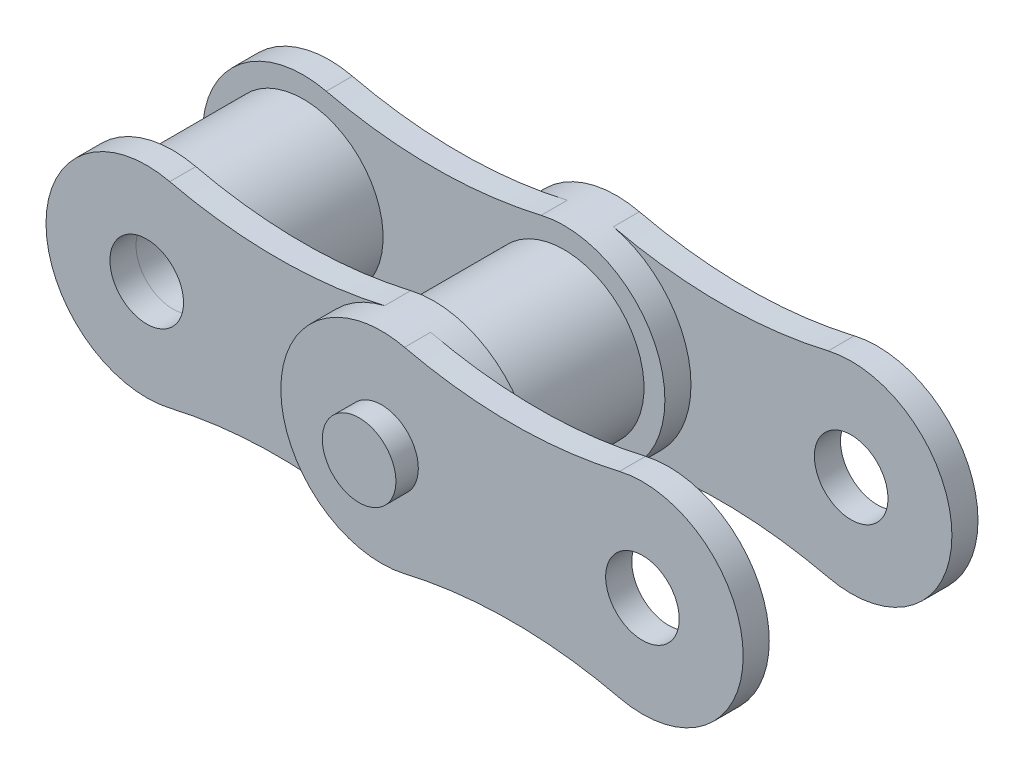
from build123d import *
from build123d.topology import SkipClean

# Parameters (mm, degrees)
SKETCH4_R             = 3.8862
SKETCH4_R_2           = 1.8161
BOSS_EXTRUDE1_DEPTH   = 3.175
BOSS_EXTRUDE1_2_DEPTH = 3.175
SKETCH5_R             = 1.7907
BOSS_EXTRUDE2_DEPTH   = 1.27
SKETCH8_R             = 1.7907
BOSS_EXTRUDE3_DEPTH   = 1.27
SKETCH9_R             = 1.7907
BOSS_EXTRUDE4_DEPTH   = 1.27
SKETCH10_R            = 1.7907
BOSS_EXTRUDE5_DEPTH   = 13.5128


with BuildPart() as part:
    # Sketch4 → Boss-Extrude1 (new, symmetric)
    with BuildSketch(Plane.XY):
        with Locations((-6.35, 0)):
            Circle(SKETCH4_R)
        with Locations((-6.35, 0)):
            Circle(SKETCH4_R_2, mode=Mode.SUBTRACT)
    extrude(amount=BOSS_EXTRUDE1_DEPTH, both=True)


with BuildPart() as body_2:
    # Sketch4 → Boss-Extrude1 2 (new, symmetric)
    with BuildSketch(Plane.XY):
        with Locations((6.35, 0)):
            Circle(SKETCH4_R)
        with Locations((6.35, 0)):
            Circle(SKETCH4_R_2, mode=Mode.SUBTRACT)
    extrude(amount=BOSS_EXTRUDE1_2_DEPTH, both=True)


with BuildPart() as body_3:
    # Sketch5 → Boss-Extrude2 (new body)
    with BuildSketch(Plane.XY.offset(3.175)):
        with BuildLine():
            ThreePointArc((-5.229673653, 4.772466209), (-11.2522, 0), (-5.229673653, -4.772466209))
            ThreePointArc((-5.229673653, -4.772466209), (0, -4.16687), (5.229673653, -4.772466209))
            ThreePointArc((5.229673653, -4.772466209), (11.2522, 0), (5.229673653, 4.772466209))
            ThreePointArc((5.229673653, 4.772466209), (0, 4.16687), (-5.229673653, 4.772466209))
        make_face()
        with Locations((-6.35, 0)):
            Circle(SKETCH5_R, mode=Mode.SUBTRACT)
        with Locations((6.35, 0)):
            Circle(SKETCH5_R, mode=Mode.SUBTRACT)
    extrude(amount=BOSS_EXTRUDE2_DEPTH)


with BuildPart() as body_4:
    # Mirror3: mirrored copy
    add(body_3.part.mirror(Plane.XY))

    # Combine2: union body 3, body 2, part
    add(body_3.part)
    add(body_2.part)
    add(part.part)

    # Sketch8 → Boss-Extrude3 (add)
    with BuildSketch(Plane.XY.offset(4.445)):
        with BuildLine():
            ThreePointArc((7.470326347, 4.772466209), (1.4478, 0), (7.470326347, -4.772466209))
            ThreePointArc((7.470326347, -4.772466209), (12.7, -4.16687), (17.929673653, -4.772466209))
            ThreePointArc((17.929673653, -4.772466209), (23.9522, 0), (17.929673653, 4.772466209))
            ThreePointArc((17.929673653, 4.772466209), (12.7, 4.16687), (7.470326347, 4.772466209))
        make_face()
        with Locations((19.05, 0)):
            Circle(SKETCH8_R, mode=Mode.SUBTRACT)
        with Locations((6.35, 0)):
            Circle(SKETCH8_R, mode=Mode.SUBTRACT)
    extrude(amount=BOSS_EXTRUDE3_DEPTH)

    # Sketch9 → Boss-Extrude4 (add)
    with SkipClean():  # the faces are left unmerged after this step: merging them gives an invalid solid
        with BuildSketch(Plane(origin=(0, 0, -4.445), x_dir=(-1, 0, 0), z_dir=(0, 0, -1))):
            with BuildLine():
                ThreePointArc((-17.929673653, 4.772466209), (-23.9522, 0), (-17.929673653, -4.772466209))
                ThreePointArc((-17.929673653, -4.772466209), (-12.7, -4.16687), (-7.470326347, -4.772466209))
                ThreePointArc((-7.470326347, -4.772466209), (-1.4478, 0), (-7.470326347, 4.772466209))
                ThreePointArc((-7.470326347, 4.772466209), (-12.7, 4.16687), (-17.929673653, 4.772466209))
            make_face()
            with Locations(Location((-19.05, 0, 0), (0, 0, 180))):
                Circle(SKETCH9_R, mode=Mode.SUBTRACT)
            with Locations((-6.35, 0)):
                Circle(SKETCH9_R, mode=Mode.SUBTRACT)
        extrude(amount=BOSS_EXTRUDE4_DEPTH)

    # Sketch10 → Boss-Extrude5 (add)
    with BuildSketch(Plane(origin=(0, 0, -6.7056), x_dir=(-1, 0, 0), z_dir=(0, 0, -1))):
        with Locations((-6.35, 0)):
            Circle(SKETCH10_R)
    extrude(amount=-BOSS_EXTRUDE5_DEPTH)


solid = body_4.part
